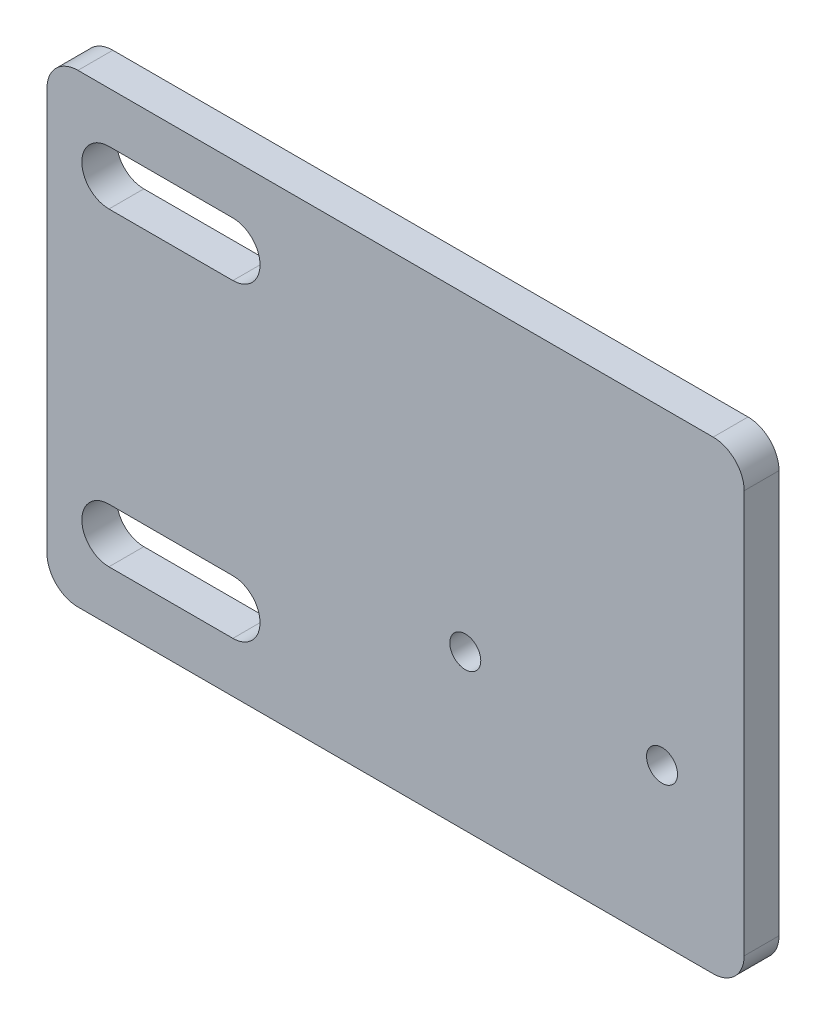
ISO-10303-21;
HEADER;
FILE_DESCRIPTION(('STEP AP214'),'2;1');
FILE_NAME('part.step','',(''),(''),'','','');
FILE_SCHEMA(('AUTOMOTIVE_DESIGN { 1 0 10303 214 1 1 1 1 }'));
ENDSEC;
DATA;
#1=APPLICATION_CONTEXT('core data for automotive mechanical design processes');
#2=APPLICATION_PROTOCOL_DEFINITION('international standard','automotive_design',2000,#1);
#3=PRODUCT_CONTEXT('',#1,'mechanical');
#4=PRODUCT('Part','Part','',(#3));
#5=PRODUCT_RELATED_PRODUCT_CATEGORY('part','',(#4));
#6=PRODUCT_DEFINITION_FORMATION('','',#4);
#7=PRODUCT_DEFINITION_CONTEXT('part definition',#1,'design');
#8=PRODUCT_DEFINITION('design','',#6,#7);
#9=PRODUCT_DEFINITION_SHAPE('','',#8);
#10=(LENGTH_UNIT() NAMED_UNIT(*) SI_UNIT(.MILLI.,.METRE.));
#11=(NAMED_UNIT(*) PLANE_ANGLE_UNIT() SI_UNIT($,.RADIAN.));
#12=(NAMED_UNIT(*) SI_UNIT($,.STERADIAN.) SOLID_ANGLE_UNIT());
#13=UNCERTAINTY_MEASURE_WITH_UNIT(LENGTH_MEASURE(1.E-05),#10,'distance_accuracy_value','');
#14=(GEOMETRIC_REPRESENTATION_CONTEXT(3) GLOBAL_UNCERTAINTY_ASSIGNED_CONTEXT((#13)) GLOBAL_UNIT_ASSIGNED_CONTEXT((#10,
#11,#12)) REPRESENTATION_CONTEXT('',''));
#15=CARTESIAN_POINT('',(0.,0.,0.));
#16=DIRECTION('',(0.,0.,1.));
#17=DIRECTION('',(1.,0.,0.));
#18=AXIS2_PLACEMENT_3D('',#15,#16,#17);
#19=CARTESIAN_POINT('',(-4.,-6.,4.5));
#20=DIRECTION('',(0.,0.,1.));
#21=DIRECTION('',(0.,-1.,0.));
#22=AXIS2_PLACEMENT_3D('',#19,#20,#21);
#23=PLANE('',#22);
#24=CARTESIAN_POINT('',(46.,10.,4.5));
#25=DIRECTION('',(0.,0.,1.));
#26=DIRECTION('',(0.,-1.,0.));
#27=AXIS2_PLACEMENT_3D('',#24,#25,#26);
#28=CIRCLE('',#27,2.);
#29=CARTESIAN_POINT('',(46.,8.,4.5));
#30=VERTEX_POINT('',#29);
#31=EDGE_CURVE('E165',#30,#30,#28,.T.);
#32=ORIENTED_EDGE('',*,*,#31,.F.);
#33=EDGE_LOOP('',(#32));
#34=FACE_BOUND('',#33,.T.);
#35=CARTESIAN_POINT('',(71.4,10.,4.5));
#36=DIRECTION('',(0.,0.,1.));
#37=DIRECTION('',(0.,-1.,0.));
#38=AXIS2_PLACEMENT_3D('',#35,#36,#37);
#39=CIRCLE('',#38,2.);
#40=CARTESIAN_POINT('',(71.4,8.,4.5));
#41=VERTEX_POINT('',#40);
#42=EDGE_CURVE('E203',#41,#41,#39,.T.);
#43=ORIENTED_EDGE('',*,*,#42,.F.);
#44=EDGE_LOOP('',(#43));
#45=FACE_BOUND('',#44,.T.);
#46=CARTESIAN_POINT('',(-4.,-6.,4.5));
#47=DIRECTION('',(0.,0.,1.));
#48=DIRECTION('',(0.,-1.,0.));
#49=AXIS2_PLACEMENT_3D('',#46,#47,#48);
#50=CIRCLE('',#49,4.);
#51=CARTESIAN_POINT('',(-8.,-6.,4.5));
#52=VERTEX_POINT('',#51);
#53=CARTESIAN_POINT('',(-4.,-10.,4.5));
#54=VERTEX_POINT('',#53);
#55=EDGE_CURVE('E230',#52,#54,#50,.T.);
#56=ORIENTED_EDGE('',*,*,#55,.T.);
#57=DIRECTION('',(-1.,0.,0.));
#58=VECTOR('',#57,1.);
#59=CARTESIAN_POINT('',(78.,-10.,4.5));
#60=LINE('',#59,#58);
#61=CARTESIAN_POINT('',(78.,-10.,4.5));
#62=VERTEX_POINT('',#61);
#63=EDGE_CURVE('E233',#62,#54,#60,.T.);
#64=ORIENTED_EDGE('',*,*,#63,.F.);
#65=CARTESIAN_POINT('',(78.,-6.,4.5));
#66=DIRECTION('',(0.,0.,1.));
#67=DIRECTION('',(0.,-1.,0.));
#68=AXIS2_PLACEMENT_3D('',#65,#66,#67);
#69=CIRCLE('',#68,4.);
#70=CARTESIAN_POINT('',(82.,-6.,4.5));
#71=VERTEX_POINT('',#70);
#72=EDGE_CURVE('E236',#62,#71,#69,.T.);
#73=ORIENTED_EDGE('',*,*,#72,.T.);
#74=DIRECTION('',(0.,-1.,0.));
#75=VECTOR('',#74,1.);
#76=CARTESIAN_POINT('',(82.,46.,4.5));
#77=LINE('',#76,#75);
#78=CARTESIAN_POINT('',(82.,46.,4.5));
#79=VERTEX_POINT('',#78);
#80=EDGE_CURVE('E239',#79,#71,#77,.T.);
#81=ORIENTED_EDGE('',*,*,#80,.F.);
#82=CARTESIAN_POINT('',(78.,46.,4.5));
#83=DIRECTION('',(0.,0.,1.));
#84=DIRECTION('',(0.,-1.,0.));
#85=AXIS2_PLACEMENT_3D('',#82,#83,#84);
#86=CIRCLE('',#85,4.);
#87=CARTESIAN_POINT('',(78.,50.,4.5));
#88=VERTEX_POINT('',#87);
#89=EDGE_CURVE('E242',#79,#88,#86,.T.);
#90=ORIENTED_EDGE('',*,*,#89,.T.);
#91=DIRECTION('',(-1.,0.,0.));
#92=VECTOR('',#91,1.);
#93=CARTESIAN_POINT('',(78.,50.,4.5));
#94=LINE('',#93,#92);
#95=CARTESIAN_POINT('',(-4.,50.,4.5));
#96=VERTEX_POINT('',#95);
#97=EDGE_CURVE('E245',#88,#96,#94,.T.);
#98=ORIENTED_EDGE('',*,*,#97,.T.);
#99=CARTESIAN_POINT('',(-4.,46.,4.5));
#100=DIRECTION('',(0.,0.,1.));
#101=DIRECTION('',(0.,-1.,0.));
#102=AXIS2_PLACEMENT_3D('',#99,#100,#101);
#103=CIRCLE('',#102,4.);
#104=CARTESIAN_POINT('',(-8.,46.,4.5));
#105=VERTEX_POINT('',#104);
#106=EDGE_CURVE('E248',#96,#105,#103,.T.);
#107=ORIENTED_EDGE('',*,*,#106,.T.);
#108=DIRECTION('',(0.,-1.,0.));
#109=VECTOR('',#108,1.);
#110=CARTESIAN_POINT('',(-8.,46.,4.5));
#111=LINE('',#110,#109);
#112=EDGE_CURVE('E251',#105,#52,#111,.T.);
#113=ORIENTED_EDGE('',*,*,#112,.T.);
#114=EDGE_LOOP('',(#56,#64,#73,#81,#90,#98,#107,#113));
#115=FACE_BOUND('',#114,.T.);
#116=DIRECTION('',(1.,0.,0.));
#117=VECTOR('',#116,1.);
#118=CARTESIAN_POINT('',(0.,36.5,4.5));
#119=LINE('',#118,#117);
#120=CARTESIAN_POINT('',(0.,36.5,4.5));
#121=VERTEX_POINT('',#120);
#122=CARTESIAN_POINT('',(16.,36.5,4.5));
#123=VERTEX_POINT('',#122);
#124=EDGE_CURVE('E183',#121,#123,#119,.T.);
#125=ORIENTED_EDGE('',*,*,#124,.F.);
#126=CARTESIAN_POINT('',(0.,40.,4.5));
#127=DIRECTION('',(0.,0.,1.));
#128=DIRECTION('',(0.,-1.,0.));
#129=AXIS2_PLACEMENT_3D('',#126,#127,#128);
#130=CIRCLE('',#129,3.5);
#131=CARTESIAN_POINT('',(0.,43.5,4.5));
#132=VERTEX_POINT('',#131);
#133=EDGE_CURVE('E180',#132,#121,#130,.T.);
#134=ORIENTED_EDGE('',*,*,#133,.F.);
#135=DIRECTION('',(1.,0.,0.));
#136=VECTOR('',#135,1.);
#137=CARTESIAN_POINT('',(0.,43.5,4.5));
#138=LINE('',#137,#136);
#139=CARTESIAN_POINT('',(16.,43.5,4.5));
#140=VERTEX_POINT('',#139);
#141=EDGE_CURVE('E188',#132,#140,#138,.T.);
#142=ORIENTED_EDGE('',*,*,#141,.T.);
#143=CARTESIAN_POINT('',(16.,40.,4.5));
#144=DIRECTION('',(0.,0.,1.));
#145=DIRECTION('',(0.,-1.,0.));
#146=AXIS2_PLACEMENT_3D('',#143,#144,#145);
#147=CIRCLE('',#146,3.5);
#148=EDGE_CURVE('E186',#123,#140,#147,.T.);
#149=ORIENTED_EDGE('',*,*,#148,.F.);
#150=EDGE_LOOP('',(#125,#134,#142,#149));
#151=FACE_BOUND('',#150,.T.);
#152=DIRECTION('',(1.,0.,0.));
#153=VECTOR('',#152,1.);
#154=CARTESIAN_POINT('',(0.,-3.5,4.5));
#155=LINE('',#154,#153);
#156=CARTESIAN_POINT('',(0.,-3.5,4.5));
#157=VERTEX_POINT('',#156);
#158=CARTESIAN_POINT('',(16.,-3.5,4.5));
#159=VERTEX_POINT('',#158);
#160=EDGE_CURVE('E152',#157,#159,#155,.T.);
#161=ORIENTED_EDGE('',*,*,#160,.F.);
#162=CARTESIAN_POINT('',(0.,0.,4.5));
#163=DIRECTION('',(0.,0.,1.));
#164=DIRECTION('',(0.,-1.,0.));
#165=AXIS2_PLACEMENT_3D('',#162,#163,#164);
#166=CIRCLE('',#165,3.5);
#167=CARTESIAN_POINT('',(0.,3.5,4.5));
#168=VERTEX_POINT('',#167);
#169=EDGE_CURVE('E128',#168,#157,#166,.T.);
#170=ORIENTED_EDGE('',*,*,#169,.F.);
#171=DIRECTION('',(1.,0.,0.));
#172=VECTOR('',#171,1.);
#173=CARTESIAN_POINT('',(0.,3.5,4.5));
#174=LINE('',#173,#172);
#175=CARTESIAN_POINT('',(16.,3.5,4.5));
#176=VERTEX_POINT('',#175);
#177=EDGE_CURVE('E155',#168,#176,#174,.T.);
#178=ORIENTED_EDGE('',*,*,#177,.T.);
#179=CARTESIAN_POINT('',(16.,0.,4.5));
#180=DIRECTION('',(0.,0.,1.));
#181=DIRECTION('',(0.,-1.,0.));
#182=AXIS2_PLACEMENT_3D('',#179,#180,#181);
#183=CIRCLE('',#182,3.5);
#184=EDGE_CURVE('E29',#159,#176,#183,.T.);
#185=ORIENTED_EDGE('',*,*,#184,.F.);
#186=EDGE_LOOP('',(#161,#170,#178,#185));
#187=FACE_BOUND('',#186,.T.);
#188=ADVANCED_FACE('F14',(#34,#45,#115,#151,#187),#23,.T.);
#189=CARTESIAN_POINT('',(-4.,-6.,0.));
#190=DIRECTION('',(0.,0.,1.));
#191=DIRECTION('',(0.,-1.,0.));
#192=AXIS2_PLACEMENT_3D('',#189,#190,#191);
#193=PLANE('',#192);
#194=CARTESIAN_POINT('',(46.,10.,0.));
#195=DIRECTION('',(0.,0.,1.));
#196=DIRECTION('',(0.,-1.,0.));
#197=AXIS2_PLACEMENT_3D('',#194,#195,#196);
#198=CIRCLE('',#197,2.);
#199=CARTESIAN_POINT('',(46.,8.,0.));
#200=VERTEX_POINT('',#199);
#201=EDGE_CURVE('E132',#200,#200,#198,.T.);
#202=ORIENTED_EDGE('',*,*,#201,.T.);
#203=EDGE_LOOP('',(#202));
#204=FACE_BOUND('',#203,.T.);
#205=CARTESIAN_POINT('',(71.4,10.,0.));
#206=DIRECTION('',(0.,0.,1.));
#207=DIRECTION('',(0.,-1.,0.));
#208=AXIS2_PLACEMENT_3D('',#205,#206,#207);
#209=CIRCLE('',#208,2.);
#210=CARTESIAN_POINT('',(71.4,8.,0.));
#211=VERTEX_POINT('',#210);
#212=EDGE_CURVE('E200',#211,#211,#209,.T.);
#213=ORIENTED_EDGE('',*,*,#212,.T.);
#214=EDGE_LOOP('',(#213));
#215=FACE_BOUND('',#214,.T.);
#216=CARTESIAN_POINT('',(-4.,-6.,0.));
#217=DIRECTION('',(0.,0.,1.));
#218=DIRECTION('',(0.,-1.,0.));
#219=AXIS2_PLACEMENT_3D('',#216,#217,#218);
#220=CIRCLE('',#219,4.);
#221=CARTESIAN_POINT('',(-8.,-6.,0.));
#222=VERTEX_POINT('',#221);
#223=CARTESIAN_POINT('',(-4.,-10.,0.));
#224=VERTEX_POINT('',#223);
#225=EDGE_CURVE('E206',#222,#224,#220,.T.);
#226=ORIENTED_EDGE('',*,*,#225,.F.);
#227=DIRECTION('',(0.,-1.,0.));
#228=VECTOR('',#227,1.);
#229=CARTESIAN_POINT('',(-8.,46.,0.));
#230=LINE('',#229,#228);
#231=CARTESIAN_POINT('',(-8.,46.,0.));
#232=VERTEX_POINT('',#231);
#233=EDGE_CURVE('E227',#232,#222,#230,.T.);
#234=ORIENTED_EDGE('',*,*,#233,.F.);
#235=CARTESIAN_POINT('',(-4.,46.,0.));
#236=DIRECTION('',(0.,0.,1.));
#237=DIRECTION('',(0.,-1.,0.));
#238=AXIS2_PLACEMENT_3D('',#235,#236,#237);
#239=CIRCLE('',#238,4.);
#240=CARTESIAN_POINT('',(-4.,50.,0.));
#241=VERTEX_POINT('',#240);
#242=EDGE_CURVE('E224',#241,#232,#239,.T.);
#243=ORIENTED_EDGE('',*,*,#242,.F.);
#244=DIRECTION('',(-1.,0.,0.));
#245=VECTOR('',#244,1.);
#246=CARTESIAN_POINT('',(78.,50.,0.));
#247=LINE('',#246,#245);
#248=CARTESIAN_POINT('',(78.,50.,0.));
#249=VERTEX_POINT('',#248);
#250=EDGE_CURVE('E221',#249,#241,#247,.T.);
#251=ORIENTED_EDGE('',*,*,#250,.F.);
#252=CARTESIAN_POINT('',(78.,46.,0.));
#253=DIRECTION('',(0.,0.,1.));
#254=DIRECTION('',(0.,-1.,0.));
#255=AXIS2_PLACEMENT_3D('',#252,#253,#254);
#256=CIRCLE('',#255,4.);
#257=CARTESIAN_POINT('',(82.,46.,0.));
#258=VERTEX_POINT('',#257);
#259=EDGE_CURVE('E218',#258,#249,#256,.T.);
#260=ORIENTED_EDGE('',*,*,#259,.F.);
#261=DIRECTION('',(0.,-1.,0.));
#262=VECTOR('',#261,1.);
#263=CARTESIAN_POINT('',(82.,46.,0.));
#264=LINE('',#263,#262);
#265=CARTESIAN_POINT('',(82.,-6.,0.));
#266=VERTEX_POINT('',#265);
#267=EDGE_CURVE('E215',#258,#266,#264,.T.);
#268=ORIENTED_EDGE('',*,*,#267,.T.);
#269=CARTESIAN_POINT('',(78.,-6.,0.));
#270=DIRECTION('',(0.,0.,1.));
#271=DIRECTION('',(0.,-1.,0.));
#272=AXIS2_PLACEMENT_3D('',#269,#270,#271);
#273=CIRCLE('',#272,4.);
#274=CARTESIAN_POINT('',(78.,-10.,0.));
#275=VERTEX_POINT('',#274);
#276=EDGE_CURVE('E212',#275,#266,#273,.T.);
#277=ORIENTED_EDGE('',*,*,#276,.F.);
#278=DIRECTION('',(-1.,0.,0.));
#279=VECTOR('',#278,1.);
#280=CARTESIAN_POINT('',(78.,-10.,0.));
#281=LINE('',#280,#279);
#282=EDGE_CURVE('E209',#275,#224,#281,.T.);
#283=ORIENTED_EDGE('',*,*,#282,.T.);
#284=EDGE_LOOP('',(#226,#234,#243,#251,#260,#268,#277,#283));
#285=FACE_BOUND('',#284,.T.);
#286=CARTESIAN_POINT('',(0.,40.,0.));
#287=DIRECTION('',(0.,0.,1.));
#288=DIRECTION('',(0.,-1.,0.));
#289=AXIS2_PLACEMENT_3D('',#286,#287,#288);
#290=CIRCLE('',#289,3.5);
#291=CARTESIAN_POINT('',(0.,43.5,0.));
#292=VERTEX_POINT('',#291);
#293=CARTESIAN_POINT('',(0.,36.5,0.));
#294=VERTEX_POINT('',#293);
#295=EDGE_CURVE('E168',#292,#294,#290,.T.);
#296=ORIENTED_EDGE('',*,*,#295,.T.);
#297=DIRECTION('',(1.,0.,0.));
#298=VECTOR('',#297,1.);
#299=CARTESIAN_POINT('',(0.,36.5,0.));
#300=LINE('',#299,#298);
#301=CARTESIAN_POINT('',(16.,36.5,0.));
#302=VERTEX_POINT('',#301);
#303=EDGE_CURVE('E171',#294,#302,#300,.T.);
#304=ORIENTED_EDGE('',*,*,#303,.T.);
#305=CARTESIAN_POINT('',(16.,40.,0.));
#306=DIRECTION('',(0.,0.,1.));
#307=DIRECTION('',(0.,-1.,0.));
#308=AXIS2_PLACEMENT_3D('',#305,#306,#307);
#309=CIRCLE('',#308,3.5);
#310=CARTESIAN_POINT('',(16.,43.5,0.));
#311=VERTEX_POINT('',#310);
#312=EDGE_CURVE('E174',#302,#311,#309,.T.);
#313=ORIENTED_EDGE('',*,*,#312,.T.);
#314=DIRECTION('',(1.,0.,0.));
#315=VECTOR('',#314,1.);
#316=CARTESIAN_POINT('',(0.,43.5,0.));
#317=LINE('',#316,#315);
#318=EDGE_CURVE('E177',#292,#311,#317,.T.);
#319=ORIENTED_EDGE('',*,*,#318,.F.);
#320=EDGE_LOOP('',(#296,#304,#313,#319));
#321=FACE_BOUND('',#320,.T.);
#322=CARTESIAN_POINT('',(0.,0.,0.));
#323=DIRECTION('',(0.,0.,1.));
#324=DIRECTION('',(0.,-1.,0.));
#325=AXIS2_PLACEMENT_3D('',#322,#323,#324);
#326=CIRCLE('',#325,3.5);
#327=CARTESIAN_POINT('',(0.,3.5,0.));
#328=VERTEX_POINT('',#327);
#329=CARTESIAN_POINT('',(0.,-3.5,0.));
#330=VERTEX_POINT('',#329);
#331=EDGE_CURVE('E37',#328,#330,#326,.T.);
#332=ORIENTED_EDGE('',*,*,#331,.T.);
#333=DIRECTION('',(1.,0.,0.));
#334=VECTOR('',#333,1.);
#335=CARTESIAN_POINT('',(0.,-3.5,0.));
#336=LINE('',#335,#334);
#337=CARTESIAN_POINT('',(16.,-3.5,0.));
#338=VERTEX_POINT('',#337);
#339=EDGE_CURVE('E136',#330,#338,#336,.T.);
#340=ORIENTED_EDGE('',*,*,#339,.T.);
#341=CARTESIAN_POINT('',(16.,0.,0.));
#342=DIRECTION('',(0.,0.,1.));
#343=DIRECTION('',(0.,-1.,0.));
#344=AXIS2_PLACEMENT_3D('',#341,#342,#343);
#345=CIRCLE('',#344,3.5);
#346=CARTESIAN_POINT('',(16.,3.5,0.));
#347=VERTEX_POINT('',#346);
#348=EDGE_CURVE('E141',#338,#347,#345,.T.);
#349=ORIENTED_EDGE('',*,*,#348,.T.);
#350=DIRECTION('',(1.,0.,0.));
#351=VECTOR('',#350,1.);
#352=CARTESIAN_POINT('',(0.,3.5,0.));
#353=LINE('',#352,#351);
#354=EDGE_CURVE('E146',#328,#347,#353,.T.);
#355=ORIENTED_EDGE('',*,*,#354,.F.);
#356=EDGE_LOOP('',(#332,#340,#349,#355));
#357=FACE_BOUND('',#356,.T.);
#358=ADVANCED_FACE('F144',(#204,#215,#285,#321,#357),#193,.F.);
#359=CARTESIAN_POINT('',(-4.,-6.,4.5));
#360=DIRECTION('',(0.,0.,-1.));
#361=DIRECTION('',(0.,1.,0.));
#362=AXIS2_PLACEMENT_3D('',#359,#360,#361);
#363=CYLINDRICAL_SURFACE('',#362,4.);
#364=DIRECTION('',(0.,0.,-1.));
#365=VECTOR('',#364,1.);
#366=CARTESIAN_POINT('',(-4.,-10.,4.5));
#367=LINE('',#366,#365);
#368=EDGE_CURVE('E9',#54,#224,#367,.T.);
#369=ORIENTED_EDGE('',*,*,#368,.F.);
#370=ORIENTED_EDGE('',*,*,#55,.F.);
#371=DIRECTION('',(0.,0.,-1.));
#372=VECTOR('',#371,1.);
#373=CARTESIAN_POINT('',(-8.,-6.,4.5));
#374=LINE('',#373,#372);
#375=EDGE_CURVE('E254',#52,#222,#374,.T.);
#376=ORIENTED_EDGE('',*,*,#375,.T.);
#377=ORIENTED_EDGE('',*,*,#225,.T.);
#378=EDGE_LOOP('',(#369,#370,#376,#377));
#379=FACE_BOUND('',#378,.T.);
#380=ADVANCED_FACE('F287',(#379),#363,.T.);
#381=CARTESIAN_POINT('',(78.,-10.,4.5));
#382=DIRECTION('',(0.,-1.,0.));
#383=DIRECTION('',(0.,0.,-1.));
#384=AXIS2_PLACEMENT_3D('',#381,#382,#383);
#385=PLANE('',#384);
#386=DIRECTION('',(0.,0.,-1.));
#387=VECTOR('',#386,1.);
#388=CARTESIAN_POINT('',(78.,-10.,4.5));
#389=LINE('',#388,#387);
#390=EDGE_CURVE('E22',#62,#275,#389,.T.);
#391=ORIENTED_EDGE('',*,*,#390,.F.);
#392=ORIENTED_EDGE('',*,*,#63,.T.);
#393=ORIENTED_EDGE('',*,*,#368,.T.);
#394=ORIENTED_EDGE('',*,*,#282,.F.);
#395=EDGE_LOOP('',(#391,#392,#393,#394));
#396=FACE_BOUND('',#395,.T.);
#397=ADVANCED_FACE('F16',(#396),#385,.T.);
#398=CARTESIAN_POINT('',(78.,-6.,4.5));
#399=DIRECTION('',(0.,0.,-1.));
#400=DIRECTION('',(0.,1.,0.));
#401=AXIS2_PLACEMENT_3D('',#398,#399,#400);
#402=CYLINDRICAL_SURFACE('',#401,4.);
#403=DIRECTION('',(0.,0.,-1.));
#404=VECTOR('',#403,1.);
#405=CARTESIAN_POINT('',(82.,-6.,4.5));
#406=LINE('',#405,#404);
#407=EDGE_CURVE('E264',#71,#266,#406,.T.);
#408=ORIENTED_EDGE('',*,*,#407,.F.);
#409=ORIENTED_EDGE('',*,*,#72,.F.);
#410=ORIENTED_EDGE('',*,*,#390,.T.);
#411=ORIENTED_EDGE('',*,*,#276,.T.);
#412=EDGE_LOOP('',(#408,#409,#410,#411));
#413=FACE_BOUND('',#412,.T.);
#414=ADVANCED_FACE('F268',(#413),#402,.T.);
#415=CARTESIAN_POINT('',(82.,46.,4.5));
#416=DIRECTION('',(1.,0.,0.));
#417=DIRECTION('',(0.,0.,1.));
#418=AXIS2_PLACEMENT_3D('',#415,#416,#417);
#419=PLANE('',#418);
#420=DIRECTION('',(0.,0.,-1.));
#421=VECTOR('',#420,1.);
#422=CARTESIAN_POINT('',(82.,46.,4.5));
#423=LINE('',#422,#421);
#424=EDGE_CURVE('E262',#79,#258,#423,.T.);
#425=ORIENTED_EDGE('',*,*,#424,.F.);
#426=ORIENTED_EDGE('',*,*,#80,.T.);
#427=ORIENTED_EDGE('',*,*,#407,.T.);
#428=ORIENTED_EDGE('',*,*,#267,.F.);
#429=EDGE_LOOP('',(#425,#426,#427,#428));
#430=FACE_BOUND('',#429,.T.);
#431=ADVANCED_FACE('F279',(#430),#419,.T.);
#432=CARTESIAN_POINT('',(78.,46.,4.5));
#433=DIRECTION('',(0.,0.,-1.));
#434=DIRECTION('',(0.,1.,0.));
#435=AXIS2_PLACEMENT_3D('',#432,#433,#434);
#436=CYLINDRICAL_SURFACE('',#435,4.);
#437=DIRECTION('',(0.,0.,-1.));
#438=VECTOR('',#437,1.);
#439=CARTESIAN_POINT('',(78.,50.,4.5));
#440=LINE('',#439,#438);
#441=EDGE_CURVE('E260',#88,#249,#440,.T.);
#442=ORIENTED_EDGE('',*,*,#441,.F.);
#443=ORIENTED_EDGE('',*,*,#89,.F.);
#444=ORIENTED_EDGE('',*,*,#424,.T.);
#445=ORIENTED_EDGE('',*,*,#259,.T.);
#446=EDGE_LOOP('',(#442,#443,#444,#445));
#447=FACE_BOUND('',#446,.T.);
#448=ADVANCED_FACE('F299',(#447),#436,.T.);
#449=CARTESIAN_POINT('',(78.,50.,4.5));
#450=DIRECTION('',(0.,-1.,0.));
#451=DIRECTION('',(0.,0.,-1.));
#452=AXIS2_PLACEMENT_3D('',#449,#450,#451);
#453=PLANE('',#452);
#454=DIRECTION('',(0.,0.,-1.));
#455=VECTOR('',#454,1.);
#456=CARTESIAN_POINT('',(-4.,50.,4.5));
#457=LINE('',#456,#455);
#458=EDGE_CURVE('E258',#96,#241,#457,.T.);
#459=ORIENTED_EDGE('',*,*,#458,.F.);
#460=ORIENTED_EDGE('',*,*,#97,.F.);
#461=ORIENTED_EDGE('',*,*,#441,.T.);
#462=ORIENTED_EDGE('',*,*,#250,.T.);
#463=EDGE_LOOP('',(#459,#460,#461,#462));
#464=FACE_BOUND('',#463,.T.);
#465=ADVANCED_FACE('F296',(#464),#453,.F.);
#466=CARTESIAN_POINT('',(-4.,46.,4.5));
#467=DIRECTION('',(0.,0.,-1.));
#468=DIRECTION('',(0.,1.,0.));
#469=AXIS2_PLACEMENT_3D('',#466,#467,#468);
#470=CYLINDRICAL_SURFACE('',#469,4.);
#471=DIRECTION('',(0.,0.,-1.));
#472=VECTOR('',#471,1.);
#473=CARTESIAN_POINT('',(-8.,46.,4.5));
#474=LINE('',#473,#472);
#475=EDGE_CURVE('E256',#105,#232,#474,.T.);
#476=ORIENTED_EDGE('',*,*,#475,.F.);
#477=ORIENTED_EDGE('',*,*,#106,.F.);
#478=ORIENTED_EDGE('',*,*,#458,.T.);
#479=ORIENTED_EDGE('',*,*,#242,.T.);
#480=EDGE_LOOP('',(#476,#477,#478,#479));
#481=FACE_BOUND('',#480,.T.);
#482=ADVANCED_FACE('F294',(#481),#470,.T.);
#483=CARTESIAN_POINT('',(-8.,46.,4.5));
#484=DIRECTION('',(1.,0.,0.));
#485=DIRECTION('',(0.,0.,1.));
#486=AXIS2_PLACEMENT_3D('',#483,#484,#485);
#487=PLANE('',#486);
#488=ORIENTED_EDGE('',*,*,#112,.F.);
#489=ORIENTED_EDGE('',*,*,#475,.T.);
#490=ORIENTED_EDGE('',*,*,#233,.T.);
#491=ORIENTED_EDGE('',*,*,#375,.F.);
#492=EDGE_LOOP('',(#488,#489,#490,#491));
#493=FACE_BOUND('',#492,.T.);
#494=ADVANCED_FACE('F291',(#493),#487,.F.);
#495=CARTESIAN_POINT('',(71.4,10.,4.5));
#496=DIRECTION('',(0.,0.,-1.));
#497=DIRECTION('',(0.,1.,0.));
#498=AXIS2_PLACEMENT_3D('',#495,#496,#497);
#499=CYLINDRICAL_SURFACE('',#498,2.);
#500=ORIENTED_EDGE('',*,*,#42,.T.);
#501=EDGE_LOOP('',(#500));
#502=FACE_BOUND('',#501,.T.);
#503=ORIENTED_EDGE('',*,*,#212,.F.);
#504=EDGE_LOOP('',(#503));
#505=FACE_BOUND('',#504,.T.);
#506=ADVANCED_FACE('F327',(#502,#505),#499,.F.);
#507=CARTESIAN_POINT('',(0.,40.,4.5));
#508=DIRECTION('',(0.,0.,-1.));
#509=DIRECTION('',(0.,1.,0.));
#510=AXIS2_PLACEMENT_3D('',#507,#508,#509);
#511=CYLINDRICAL_SURFACE('',#510,3.5);
#512=DIRECTION('',(0.,0.,-1.));
#513=VECTOR('',#512,1.);
#514=CARTESIAN_POINT('',(0.,36.5,4.5));
#515=LINE('',#514,#513);
#516=EDGE_CURVE('E198',#121,#294,#515,.T.);
#517=ORIENTED_EDGE('',*,*,#516,.T.);
#518=ORIENTED_EDGE('',*,*,#295,.F.);
#519=DIRECTION('',(0.,0.,-1.));
#520=VECTOR('',#519,1.);
#521=CARTESIAN_POINT('',(0.,43.5,4.5));
#522=LINE('',#521,#520);
#523=EDGE_CURVE('E191',#132,#292,#522,.T.);
#524=ORIENTED_EDGE('',*,*,#523,.F.);
#525=ORIENTED_EDGE('',*,*,#133,.T.);
#526=EDGE_LOOP('',(#517,#518,#524,#525));
#527=FACE_BOUND('',#526,.T.);
#528=ADVANCED_FACE('F351',(#527),#511,.F.);
#529=CARTESIAN_POINT('',(0.,36.5,4.5));
#530=DIRECTION('',(0.,1.,0.));
#531=DIRECTION('',(0.,0.,1.));
#532=AXIS2_PLACEMENT_3D('',#529,#530,#531);
#533=PLANE('',#532);
#534=DIRECTION('',(0.,0.,-1.));
#535=VECTOR('',#534,1.);
#536=CARTESIAN_POINT('',(16.,36.5,4.5));
#537=LINE('',#536,#535);
#538=EDGE_CURVE('E196',#123,#302,#537,.T.);
#539=ORIENTED_EDGE('',*,*,#538,.T.);
#540=ORIENTED_EDGE('',*,*,#303,.F.);
#541=ORIENTED_EDGE('',*,*,#516,.F.);
#542=ORIENTED_EDGE('',*,*,#124,.T.);
#543=EDGE_LOOP('',(#539,#540,#541,#542));
#544=FACE_BOUND('',#543,.T.);
#545=ADVANCED_FACE('F359',(#544),#533,.T.);
#546=CARTESIAN_POINT('',(16.,40.,4.5));
#547=DIRECTION('',(0.,0.,-1.));
#548=DIRECTION('',(0.,1.,0.));
#549=AXIS2_PLACEMENT_3D('',#546,#547,#548);
#550=CYLINDRICAL_SURFACE('',#549,3.5);
#551=DIRECTION('',(0.,0.,-1.));
#552=VECTOR('',#551,1.);
#553=CARTESIAN_POINT('',(16.,43.5,4.5));
#554=LINE('',#553,#552);
#555=EDGE_CURVE('E194',#140,#311,#554,.T.);
#556=ORIENTED_EDGE('',*,*,#555,.T.);
#557=ORIENTED_EDGE('',*,*,#312,.F.);
#558=ORIENTED_EDGE('',*,*,#538,.F.);
#559=ORIENTED_EDGE('',*,*,#148,.T.);
#560=EDGE_LOOP('',(#556,#557,#558,#559));
#561=FACE_BOUND('',#560,.T.);
#562=ADVANCED_FACE('F368',(#561),#550,.F.);
#563=CARTESIAN_POINT('',(0.,43.5,4.5));
#564=DIRECTION('',(0.,1.,0.));
#565=DIRECTION('',(0.,0.,1.));
#566=AXIS2_PLACEMENT_3D('',#563,#564,#565);
#567=PLANE('',#566);
#568=ORIENTED_EDGE('',*,*,#141,.F.);
#569=ORIENTED_EDGE('',*,*,#523,.T.);
#570=ORIENTED_EDGE('',*,*,#318,.T.);
#571=ORIENTED_EDGE('',*,*,#555,.F.);
#572=EDGE_LOOP('',(#568,#569,#570,#571));
#573=FACE_BOUND('',#572,.T.);
#574=ADVANCED_FACE('F377',(#573),#567,.F.);
#575=CARTESIAN_POINT('',(46.,10.,4.5));
#576=DIRECTION('',(0.,0.,-1.));
#577=DIRECTION('',(0.,1.,0.));
#578=AXIS2_PLACEMENT_3D('',#575,#576,#577);
#579=CYLINDRICAL_SURFACE('',#578,2.);
#580=ORIENTED_EDGE('',*,*,#31,.T.);
#581=EDGE_LOOP('',(#580));
#582=FACE_BOUND('',#581,.T.);
#583=ORIENTED_EDGE('',*,*,#201,.F.);
#584=EDGE_LOOP('',(#583));
#585=FACE_BOUND('',#584,.T.);
#586=ADVANCED_FACE('F386',(#582,#585),#579,.F.);
#587=CARTESIAN_POINT('',(0.,0.,4.5));
#588=DIRECTION('',(0.,0.,-1.));
#589=DIRECTION('',(0.,1.,0.));
#590=AXIS2_PLACEMENT_3D('',#587,#588,#589);
#591=CYLINDRICAL_SURFACE('',#590,3.5);
#592=DIRECTION('',(0.,0.,-1.));
#593=VECTOR('',#592,1.);
#594=CARTESIAN_POINT('',(0.,-3.5,4.5));
#595=LINE('',#594,#593);
#596=EDGE_CURVE('E124',#157,#330,#595,.T.);
#597=ORIENTED_EDGE('',*,*,#596,.T.);
#598=ORIENTED_EDGE('',*,*,#331,.F.);
#599=DIRECTION('',(0.,0.,-1.));
#600=VECTOR('',#599,1.);
#601=CARTESIAN_POINT('',(0.,3.5,4.5));
#602=LINE('',#601,#600);
#603=EDGE_CURVE('E158',#168,#328,#602,.T.);
#604=ORIENTED_EDGE('',*,*,#603,.F.);
#605=ORIENTED_EDGE('',*,*,#169,.T.);
#606=EDGE_LOOP('',(#597,#598,#604,#605));
#607=FACE_BOUND('',#606,.T.);
#608=ADVANCED_FACE('F126',(#607),#591,.F.);
#609=CARTESIAN_POINT('',(0.,-3.5,4.5));
#610=DIRECTION('',(0.,1.,0.));
#611=DIRECTION('',(0.,0.,1.));
#612=AXIS2_PLACEMENT_3D('',#609,#610,#611);
#613=PLANE('',#612);
#614=DIRECTION('',(0.,0.,-1.));
#615=VECTOR('',#614,1.);
#616=CARTESIAN_POINT('',(16.,-3.5,4.5));
#617=LINE('',#616,#615);
#618=EDGE_CURVE('E133',#159,#338,#617,.T.);
#619=ORIENTED_EDGE('',*,*,#618,.T.);
#620=ORIENTED_EDGE('',*,*,#339,.F.);
#621=ORIENTED_EDGE('',*,*,#596,.F.);
#622=ORIENTED_EDGE('',*,*,#160,.T.);
#623=EDGE_LOOP('',(#619,#620,#621,#622));
#624=FACE_BOUND('',#623,.T.);
#625=ADVANCED_FACE('F137',(#624),#613,.T.);
#626=CARTESIAN_POINT('',(16.,0.,4.5));
#627=DIRECTION('',(0.,0.,-1.));
#628=DIRECTION('',(0.,1.,0.));
#629=AXIS2_PLACEMENT_3D('',#626,#627,#628);
#630=CYLINDRICAL_SURFACE('',#629,3.5);
#631=DIRECTION('',(0.,0.,-1.));
#632=VECTOR('',#631,1.);
#633=CARTESIAN_POINT('',(16.,3.5,4.5));
#634=LINE('',#633,#632);
#635=EDGE_CURVE('E160',#176,#347,#634,.T.);
#636=ORIENTED_EDGE('',*,*,#635,.T.);
#637=ORIENTED_EDGE('',*,*,#348,.F.);
#638=ORIENTED_EDGE('',*,*,#618,.F.);
#639=ORIENTED_EDGE('',*,*,#184,.T.);
#640=EDGE_LOOP('',(#636,#637,#638,#639));
#641=FACE_BOUND('',#640,.T.);
#642=ADVANCED_FACE('F410',(#641),#630,.F.);
#643=CARTESIAN_POINT('',(0.,3.5,4.5));
#644=DIRECTION('',(0.,1.,0.));
#645=DIRECTION('',(0.,0.,1.));
#646=AXIS2_PLACEMENT_3D('',#643,#644,#645);
#647=PLANE('',#646);
#648=ORIENTED_EDGE('',*,*,#177,.F.);
#649=ORIENTED_EDGE('',*,*,#603,.T.);
#650=ORIENTED_EDGE('',*,*,#354,.T.);
#651=ORIENTED_EDGE('',*,*,#635,.F.);
#652=EDGE_LOOP('',(#648,#649,#650,#651));
#653=FACE_BOUND('',#652,.T.);
#654=ADVANCED_FACE('F418',(#653),#647,.F.);
#655=CLOSED_SHELL('',(#188,#358,#380,#397,#414,#431,#448,#465,#482,#494,#506,#528,#545,#562,
#574,#586,#608,#625,#642,#654));
#656=MANIFOLD_SOLID_BREP('B1',#655);
#657=ADVANCED_BREP_SHAPE_REPRESENTATION('',(#18,#656),#14);
#658=SHAPE_DEFINITION_REPRESENTATION(#9,#657);
ENDSEC;
END-ISO-10303-21;
